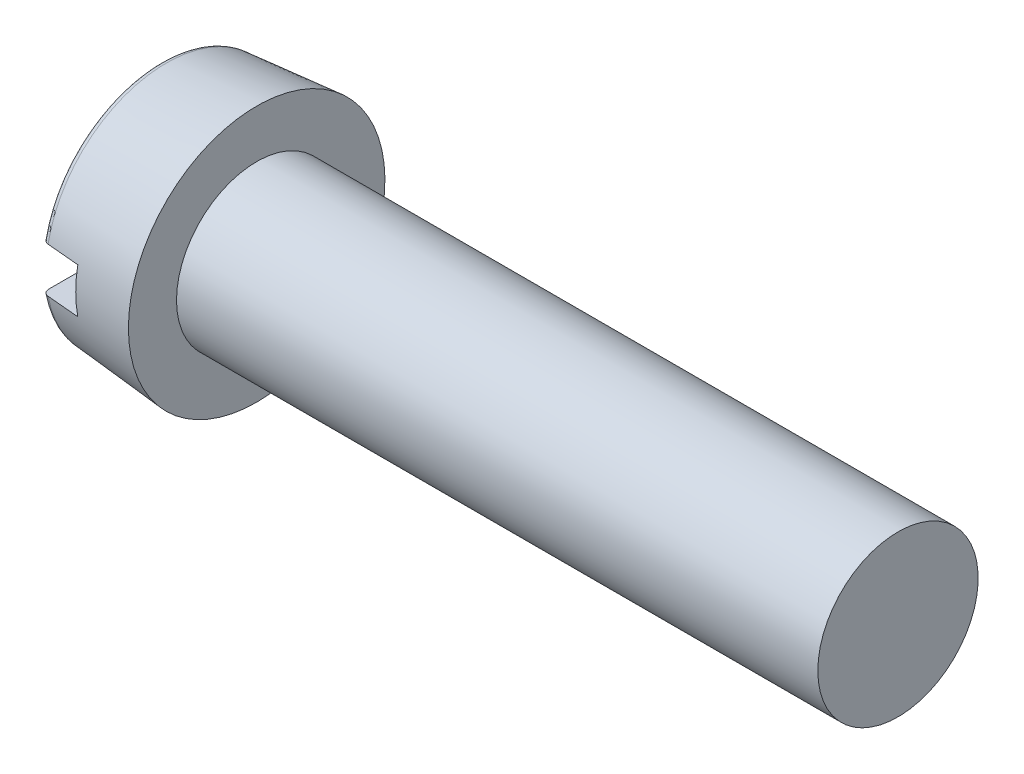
ISO-10303-21;
HEADER;
FILE_DESCRIPTION(('STEP AP214'),'2;1');
FILE_NAME('part.step','',(''),(''),'','','');
FILE_SCHEMA(('AUTOMOTIVE_DESIGN { 1 0 10303 214 1 1 1 1 }'));
ENDSEC;
DATA;
#1=APPLICATION_CONTEXT('core data for automotive mechanical design processes');
#2=APPLICATION_PROTOCOL_DEFINITION('international standard','automotive_design',2000,#1);
#3=PRODUCT_CONTEXT('',#1,'mechanical');
#4=PRODUCT('Part','Part','',(#3));
#5=PRODUCT_RELATED_PRODUCT_CATEGORY('part','',(#4));
#6=PRODUCT_DEFINITION_FORMATION('','',#4);
#7=PRODUCT_DEFINITION_CONTEXT('part definition',#1,'design');
#8=PRODUCT_DEFINITION('design','',#6,#7);
#9=PRODUCT_DEFINITION_SHAPE('','',#8);
#10=(LENGTH_UNIT() NAMED_UNIT(*) SI_UNIT(.MILLI.,.METRE.));
#11=(NAMED_UNIT(*) PLANE_ANGLE_UNIT() SI_UNIT($,.RADIAN.));
#12=(NAMED_UNIT(*) SI_UNIT($,.STERADIAN.) SOLID_ANGLE_UNIT());
#13=UNCERTAINTY_MEASURE_WITH_UNIT(LENGTH_MEASURE(1.E-05),#10,'distance_accuracy_value','');
#14=(GEOMETRIC_REPRESENTATION_CONTEXT(3) GLOBAL_UNCERTAINTY_ASSIGNED_CONTEXT((#13)) GLOBAL_UNIT_ASSIGNED_CONTEXT((#10,
#11,#12)) REPRESENTATION_CONTEXT('',''));
#15=CARTESIAN_POINT('',(0.,0.,0.));
#16=DIRECTION('',(0.,0.,1.));
#17=DIRECTION('',(1.,0.,0.));
#18=AXIS2_PLACEMENT_3D('',#15,#16,#17);
#19=CARTESIAN_POINT('',(0.,0.,0.));
#20=DIRECTION('',(1.,0.,0.));
#21=DIRECTION('',(0.,0.,-1.));
#22=AXIS2_PLACEMENT_3D('',#19,#20,#21);
#23=PLANE('',#22);
#24=CARTESIAN_POINT('',(0.,0.,0.));
#25=DIRECTION('',(1.,0.,0.));
#26=DIRECTION('',(0.,0.,-1.));
#27=AXIS2_PLACEMENT_3D('',#24,#25,#26);
#28=CIRCLE('',#27,7.10853554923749);
#29=CARTESIAN_POINT('',(0.,1.405,6.96830342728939));
#30=VERTEX_POINT('',#29);
#31=CARTESIAN_POINT('',(0.,1.405,-6.96830342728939));
#32=VERTEX_POINT('',#31);
#33=EDGE_CURVE('E102',#30,#32,#28,.F.);
#34=ORIENTED_EDGE('',*,*,#33,.T.);
#35=DIRECTION('',(0.,0.,-1.));
#36=VECTOR('',#35,1.);
#37=CARTESIAN_POINT('',(0.,1.405,-8.));
#38=LINE('',#37,#36);
#39=EDGE_CURVE('E99',#30,#32,#38,.T.);
#40=ORIENTED_EDGE('',*,*,#39,.F.);
#41=EDGE_LOOP('',(#34,#40));
#42=FACE_BOUND('',#41,.T.);
#43=ADVANCED_FACE('F32',(#42),#23,.F.);
#44=CARTESIAN_POINT('',(0.4,0.,0.));
#45=DIRECTION('',(1.,0.,0.));
#46=DIRECTION('',(0.,0.,-1.));
#47=AXIS2_PLACEMENT_3D('',#44,#45,#46);
#48=TOROIDAL_SURFACE('',#47,7.10853554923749,0.4);
#49=CARTESIAN_POINT('',(0.144237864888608,1.405,-7.28177651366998));
#50=CARTESIAN_POINT('',(0.161252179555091,1.405,-7.29618568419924));
#51=CARTESIAN_POINT('',(0.179480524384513,1.405,-7.30918376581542));
#52=CARTESIAN_POINT('',(0.217869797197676,1.405,-7.33195500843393));
#53=CARTESIAN_POINT('',(0.238032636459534,1.405,-7.34172493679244));
#54=CARTESIAN_POINT('',(0.279721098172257,1.405,-7.35772789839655));
#55=CARTESIAN_POINT('',(0.301246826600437,1.405,-7.36396065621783));
#56=CARTESIAN_POINT('',(0.345038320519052,1.405,-7.3726889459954));
#57=CARTESIAN_POINT('',(0.367303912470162,1.405,-7.37518534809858));
#58=CARTESIAN_POINT('',(0.411759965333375,1.405,-7.37636018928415));
#59=CARTESIAN_POINT('',(0.433949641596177,1.405,-7.37506847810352));
#60=CARTESIAN_POINT('',(0.477795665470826,1.405,-7.36877204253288));
#61=CARTESIAN_POINT('',(0.499452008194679,1.405,-7.36376728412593));
#62=CARTESIAN_POINT('',(0.541591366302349,1.405,-7.35020943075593));
#63=CARTESIAN_POINT('',(0.562075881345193,1.405,-7.34166099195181));
#64=CARTESIAN_POINT('',(0.601337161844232,1.405,-7.32127693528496));
#65=CARTESIAN_POINT('',(0.620113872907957,1.405,-7.30944121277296));
#66=CARTESIAN_POINT('',(0.655620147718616,1.405,-7.28271030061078));
#67=CARTESIAN_POINT('',(0.672329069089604,1.405,-7.26778770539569));
#68=CARTESIAN_POINT('',(0.703054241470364,1.405,-7.2353899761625));
#69=CARTESIAN_POINT('',(0.717070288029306,1.405,-7.21791464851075));
#70=CARTESIAN_POINT('',(0.742260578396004,1.405,-7.18060195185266));
#71=CARTESIAN_POINT('',(0.7533841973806,1.405,-7.16073041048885));
#72=CARTESIAN_POINT('',(0.772203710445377,1.405,-7.11942587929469));
#73=CARTESIAN_POINT('',(0.779899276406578,1.405,-7.09799274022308));
#74=CARTESIAN_POINT('',(0.791780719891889,1.405,-7.05377013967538));
#75=CARTESIAN_POINT('',(0.795902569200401,1.405,-7.03096346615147));
#76=CARTESIAN_POINT('',(0.800307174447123,1.405,-6.98498195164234));
#77=CARTESIAN_POINT('',(0.800589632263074,1.405,-6.96180708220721));
#78=CARTESIAN_POINT('',(0.797293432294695,1.405,-6.91546354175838));
#79=CARTESIAN_POINT('',(0.793670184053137,1.405,-6.89229802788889));
#80=CARTESIAN_POINT('',(0.782586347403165,1.405,-6.84690278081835));
#81=CARTESIAN_POINT('',(0.775125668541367,1.405,-6.82467306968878));
#82=CARTESIAN_POINT('',(0.756560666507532,1.405,-6.78179429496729));
#83=CARTESIAN_POINT('',(0.745457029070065,1.405,-6.7611449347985));
#84=CARTESIAN_POINT('',(0.719896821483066,1.405,-6.72203604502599));
#85=CARTESIAN_POINT('',(0.705440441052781,1.405,-6.70357639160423));
#86=CARTESIAN_POINT('',(0.673777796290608,1.405,-6.66964171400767));
#87=CARTESIAN_POINT('',(0.656610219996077,1.405,-6.65413061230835));
#88=CARTESIAN_POINT('',(0.619866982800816,1.405,-6.62628475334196));
#89=CARTESIAN_POINT('',(0.600291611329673,1.405,-6.61394961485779));
#90=CARTESIAN_POINT('',(0.559726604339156,1.405,-6.593080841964));
#91=CARTESIAN_POINT('',(0.538775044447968,1.405,-6.58447319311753));
#92=CARTESIAN_POINT('',(0.495707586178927,1.405,-6.57097278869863));
#93=CARTESIAN_POINT('',(0.473591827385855,1.405,-6.56607958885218));
#94=CARTESIAN_POINT('',(0.429262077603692,1.405,-6.56022606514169));
#95=CARTESIAN_POINT('',(0.40705742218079,1.405,-6.55919486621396));
#96=CARTESIAN_POINT('',(0.362794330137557,1.405,-6.56090217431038));
#97=CARTESIAN_POINT('',(0.340735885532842,1.405,-6.56364047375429));
#98=CARTESIAN_POINT('',(0.297539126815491,1.405,-6.57276690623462));
#99=CARTESIAN_POINT('',(0.276395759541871,1.405,-6.57913117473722));
#100=CARTESIAN_POINT('',(0.235464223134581,1.405,-6.59528964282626));
#101=CARTESIAN_POINT('',(0.215676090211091,1.405,-6.60508393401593));
#102=CARTESIAN_POINT('',(0.177826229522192,1.405,-6.6278994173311));
#103=CARTESIAN_POINT('',(0.159780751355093,1.405,-6.64094754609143));
#104=CARTESIAN_POINT('',(0.12608439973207,1.405,-6.66983570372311));
#105=CARTESIAN_POINT('',(0.110433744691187,1.405,-6.68567598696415));
#106=CARTESIAN_POINT('',(0.0816504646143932,1.405,-6.72001835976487));
#107=CARTESIAN_POINT('',(0.0685715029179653,1.405,-6.73856541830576));
#108=CARTESIAN_POINT('',(0.0456400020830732,1.405,-6.77755676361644));
#109=CARTESIAN_POINT('',(0.0357878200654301,1.405,-6.79800126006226));
#110=CARTESIAN_POINT('',(0.0193864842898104,1.405,-6.84065313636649));
#111=CARTESIAN_POINT('',(0.012908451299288,1.405,-6.8628878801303));
#112=CARTESIAN_POINT('',(0.00372599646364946,1.405,-6.90812297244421));
#113=CARTESIAN_POINT('',(0.0010217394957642,1.405,-6.93112335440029));
#114=CARTESIAN_POINT('',(-0.000552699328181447,1.405,-6.97753918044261));
#115=CARTESIAN_POINT('',(0.000624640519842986,1.405,-7.00095625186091));
#116=CARTESIAN_POINT('',(0.00689529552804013,1.405,-7.0472674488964));
#117=CARTESIAN_POINT('',(0.011989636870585,1.405,-7.0701614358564));
#118=CARTESIAN_POINT('',(0.0259690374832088,1.405,-7.11476232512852));
#119=CARTESIAN_POINT('',(0.0348543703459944,1.405,-7.13646914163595));
#120=CARTESIAN_POINT('',(0.0561821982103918,1.405,-7.17803716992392));
#121=CARTESIAN_POINT('',(0.0686202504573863,1.405,-7.19790064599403));
#122=CARTESIAN_POINT('',(0.0916734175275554,1.405,-7.22851144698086));
#123=CARTESIAN_POINT('',(0.101349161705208,1.405,-7.23997810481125));
#124=CARTESIAN_POINT('',(0.121913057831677,1.405,-7.26176785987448));
#125=CARTESIAN_POINT('',(0.132801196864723,1.405,-7.27209096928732));
#126=CARTESIAN_POINT('',(0.144237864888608,1.405,-7.28177651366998));
#127=B_SPLINE_CURVE_WITH_KNOTS('',3,(#49,#50,#51,#52,#53,#54,#55,#56,#57,#58,#59,#60,#61,#62,
#63,#64,#65,#66,#67,#68,#69,#70,#71,#72,#73,#74,#75,#76,#77,#78,#79,#80,#81,#82,#83,#84,#85,#86,
#87,#88,#89,#90,#91,#92,#93,#94,#95,#96,#97,#98,#99,#100,#101,#102,#103,#104,#105,#106,#107,
#108,#109,#110,#111,#112,#113,#114,#115,#116,#117,#118,#119,#120,#121,#122,#123,#124,#125,#126),
.UNSPECIFIED.,.T.,.F.,(4,2,2,2,2,2,2,2,2,2,2,2,2,2,2,2,2,2,2,2,2,2,2,2,2,2,2,2,2,2,2,2,2,2,2,2,
2,2,4),(0.,0.066834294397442,0.133735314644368,0.200641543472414,0.267532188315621,
0.333897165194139,0.400262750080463,0.466541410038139,0.532822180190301,0.599718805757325,
0.666620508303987,0.734624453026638,0.802634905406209,0.871840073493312,0.941050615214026,
1.0110597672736,1.08107056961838,1.15106820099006,1.22106187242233,1.29013451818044,
1.35919886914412,1.42682080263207,1.49443464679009,1.56080139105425,1.62716448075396,
1.69309576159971,1.75902880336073,1.82552692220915,1.892031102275,1.95980251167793,
2.0275814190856,2.09673640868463,2.1658944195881,2.23590224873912,2.30592842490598,
2.37595965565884,2.44590369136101,2.49082879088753,2.535753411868),.UNSPECIFIED.);
#128=CARTESIAN_POINT('',(0.365137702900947,1.405,-7.37436272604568));
#129=VERTEX_POINT('',#128);
#130=EDGE_CURVE('E56',#32,#129,#127,.T.);
#131=ORIENTED_EDGE('',*,*,#130,.F.);
#132=ORIENTED_EDGE('',*,*,#33,.F.);
#133=CARTESIAN_POINT('',(0.144881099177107,1.405,6.65373183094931));
#134=CARTESIAN_POINT('',(0.161881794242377,1.405,6.63934448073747));
#135=CARTESIAN_POINT('',(0.180090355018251,1.405,6.62636253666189));
#136=CARTESIAN_POINT('',(0.21843547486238,1.405,6.6036162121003));
#137=CARTESIAN_POINT('',(0.23857385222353,1.405,6.59385490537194));
#138=CARTESIAN_POINT('',(0.280217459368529,1.405,6.57786728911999));
#139=CARTESIAN_POINT('',(0.301723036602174,1.405,6.57164188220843));
#140=CARTESIAN_POINT('',(0.345474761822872,1.405,6.56293606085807));
#141=CARTESIAN_POINT('',(0.367720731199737,1.405,6.56045474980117));
#142=CARTESIAN_POINT('',(0.412075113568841,1.405,6.55932205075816));
#143=CARTESIAN_POINT('',(0.434182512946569,1.405,6.56063066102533));
#144=CARTESIAN_POINT('',(0.477861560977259,1.405,6.56694897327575));
#145=CARTESIAN_POINT('',(0.499433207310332,1.405,6.57195869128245));
#146=CARTESIAN_POINT('',(0.541394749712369,1.405,6.58550595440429));
#147=CARTESIAN_POINT('',(0.561786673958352,1.405,6.59403722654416));
#148=CARTESIAN_POINT('',(0.600873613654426,1.405,6.6143609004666));
#149=CARTESIAN_POINT('',(0.619568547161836,1.405,6.62615345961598));
#150=CARTESIAN_POINT('',(0.65499110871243,1.405,6.65281311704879));
#151=CARTESIAN_POINT('',(0.671690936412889,1.405,6.6677171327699));
#152=CARTESIAN_POINT('',(0.702413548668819,1.405,6.70006655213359));
#153=CARTESIAN_POINT('',(0.716436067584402,1.405,6.71751220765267));
#154=CARTESIAN_POINT('',(0.741711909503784,1.405,6.75483184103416));
#155=CARTESIAN_POINT('',(0.752902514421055,1.405,6.77474829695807));
#156=CARTESIAN_POINT('',(0.771852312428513,1.405,6.81615166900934));
#157=CARTESIAN_POINT('',(0.779611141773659,1.405,6.83763875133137));
#158=CARTESIAN_POINT('',(0.791617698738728,1.405,6.88200474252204));
#159=CARTESIAN_POINT('',(0.795797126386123,1.405,6.90490215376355));
#160=CARTESIAN_POINT('',(0.800289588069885,1.405,6.95107381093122));
#161=CARTESIAN_POINT('',(0.800602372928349,1.405,6.97434808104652));
#162=CARTESIAN_POINT('',(0.797334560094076,1.405,7.02082625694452));
#163=CARTESIAN_POINT('',(0.793720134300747,1.405,7.04402779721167));
#164=CARTESIAN_POINT('',(0.782630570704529,1.405,7.08949023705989));
#165=CARTESIAN_POINT('',(0.775155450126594,1.405,7.11175114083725));
#166=CARTESIAN_POINT('',(0.756575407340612,1.405,7.15458716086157));
#167=CARTESIAN_POINT('',(0.74548668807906,1.405,7.17516929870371));
#168=CARTESIAN_POINT('',(0.719961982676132,1.405,7.21414252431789));
#169=CARTESIAN_POINT('',(0.705526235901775,1.405,7.23253376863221));
#170=CARTESIAN_POINT('',(0.673939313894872,1.405,7.26630759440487));
#171=CARTESIAN_POINT('',(0.656831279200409,1.405,7.28173051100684));
#172=CARTESIAN_POINT('',(0.620227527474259,1.405,7.30942091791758));
#173=CARTESIAN_POINT('',(0.600732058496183,1.405,7.32168873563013));
#174=CARTESIAN_POINT('',(0.560289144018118,1.405,7.34248600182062));
#175=CARTESIAN_POINT('',(0.539374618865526,1.405,7.3510794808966));
#176=CARTESIAN_POINT('',(0.496387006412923,1.405,7.36457593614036));
#177=CARTESIAN_POINT('',(0.474314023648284,1.405,7.36947924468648));
#178=CARTESIAN_POINT('',(0.429971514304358,1.405,7.37539616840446));
#179=CARTESIAN_POINT('',(0.407709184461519,1.405,7.37646382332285));
#180=CARTESIAN_POINT('',(0.363324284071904,1.405,7.37482660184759));
#181=CARTESIAN_POINT('',(0.341201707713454,1.405,7.37212188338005));
#182=CARTESIAN_POINT('',(0.297832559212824,1.405,7.36304702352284));
#183=CARTESIAN_POINT('',(0.276582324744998,1.405,7.3566943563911));
#184=CARTESIAN_POINT('',(0.235440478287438,1.405,7.34053288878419));
#185=CARTESIAN_POINT('',(0.215548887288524,1.405,7.33072403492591));
#186=CARTESIAN_POINT('',(0.177550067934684,1.405,7.30787537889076));
#187=CARTESIAN_POINT('',(0.15945464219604,1.405,7.294815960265));
#188=CARTESIAN_POINT('',(0.1256727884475,1.405,7.26588542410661));
#189=CARTESIAN_POINT('',(0.109986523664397,1.405,7.25001411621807));
#190=CARTESIAN_POINT('',(0.0812162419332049,1.405,7.21566368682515));
#191=CARTESIAN_POINT('',(0.0681741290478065,1.405,7.19714947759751));
#192=CARTESIAN_POINT('',(0.0453189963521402,1.405,7.15822553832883));
#193=CARTESIAN_POINT('',(0.0355062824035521,1.405,7.1378156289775));
#194=CARTESIAN_POINT('',(0.0192044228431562,1.405,7.09528646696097));
#195=CARTESIAN_POINT('',(0.0127782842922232,1.405,7.07314305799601));
#196=CARTESIAN_POINT('',(0.00367706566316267,1.405,7.028099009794));
#197=CARTESIAN_POINT('',(0.00100217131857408,1.405,7.00519833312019));
#198=CARTESIAN_POINT('',(-0.000546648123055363,1.405,6.95894569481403));
#199=CARTESIAN_POINT('',(0.000633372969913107,1.405,6.93559191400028));
#200=CARTESIAN_POINT('',(0.00688116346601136,1.405,6.88940306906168));
#201=CARTESIAN_POINT('',(0.011950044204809,1.405,6.86656815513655));
#202=CARTESIAN_POINT('',(0.0258751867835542,1.405,6.82197547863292));
#203=CARTESIAN_POINT('',(0.0347478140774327,1.405,6.80022282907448));
#204=CARTESIAN_POINT('',(0.0560477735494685,1.405,6.75855467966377));
#205=CARTESIAN_POINT('',(0.0684707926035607,1.405,6.73863698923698));
#206=CARTESIAN_POINT('',(0.0916123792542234,1.405,6.70778013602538));
#207=CARTESIAN_POINT('',(0.101407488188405,1.405,6.6961371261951));
#208=CARTESIAN_POINT('',(0.122241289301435,1.405,6.67402188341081));
#209=CARTESIAN_POINT('',(0.133279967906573,1.405,6.66354963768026));
#210=CARTESIAN_POINT('',(0.144881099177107,1.405,6.65373183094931));
#211=B_SPLINE_CURVE_WITH_KNOTS('',3,(#133,#134,#135,#136,#137,#138,#139,#140,#141,#142,#143,
#144,#145,#146,#147,#148,#149,#150,#151,#152,#153,#154,#155,#156,#157,#158,#159,#160,#161,#162,
#163,#164,#165,#166,#167,#168,#169,#170,#171,#172,#173,#174,#175,#176,#177,#178,#179,#180,#181,
#182,#183,#184,#185,#186,#187,#188,#189,#190,#191,#192,#193,#194,#195,#196,#197,#198,#199,#200,
#201,#202,#203,#204,#205,#206,#207,#208,#209,#210),.UNSPECIFIED.,.T.,.F.,(4,2,2,2,2,2,2,2,2,2,2,
2,2,2,2,2,2,2,2,2,2,2,2,2,2,2,2,2,2,2,2,2,2,2,2,2,2,2,4),(0.,0.066760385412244,0.13358430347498,
0.200425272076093,0.267250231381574,0.333372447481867,0.39949494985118,0.465500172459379,
0.531508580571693,0.598349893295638,0.665197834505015,0.733417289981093,0.801643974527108,
0.871145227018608,0.940650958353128,1.01076017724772,1.08086908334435,1.15066785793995,
1.22046164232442,1.28922713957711,1.35798549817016,1.42549128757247,1.49299099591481,
1.55953590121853,1.62607802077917,1.69230402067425,1.75853104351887,1.82516785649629,
1.89180918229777,1.95943581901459,2.02706885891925,2.09591935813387,2.1647732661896,
2.23459482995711,2.30443635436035,2.37458143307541,2.44464165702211,2.49019887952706,
2.53575560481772),.UNSPECIFIED.);
#212=CARTESIAN_POINT('',(0.365137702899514,1.405,7.37436272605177));
#213=VERTEX_POINT('',#212);
#214=EDGE_CURVE('E92',#213,#30,#211,.T.);
#215=ORIENTED_EDGE('',*,*,#214,.F.);
#216=CARTESIAN_POINT('',(0.365137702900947,0.,0.));
#217=DIRECTION('',(-1.,0.,0.));
#218=DIRECTION('',(0.,0.,1.));
#219=AXIS2_PLACEMENT_3D('',#216,#217,#218);
#220=CIRCLE('',#219,7.50701342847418);
#221=EDGE_CURVE('E101',#129,#213,#220,.F.);
#222=ORIENTED_EDGE('',*,*,#221,.F.);
#223=EDGE_LOOP('',(#131,#132,#215,#222));
#224=FACE_BOUND('',#223,.T.);
#225=ADVANCED_FACE('F181',(#224),#48,.T.);
#226=CARTESIAN_POINT('',(0.,-1.405,-6.96830342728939));
#227=VERTEX_POINT('',#226);
#228=CARTESIAN_POINT('',(0.,-1.405,6.96830342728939));
#229=VERTEX_POINT('',#228);
#230=EDGE_CURVE('E98',#227,#229,#28,.F.);
#231=ORIENTED_EDGE('',*,*,#230,.T.);
#232=DIRECTION('',(0.,0.,1.));
#233=VECTOR('',#232,1.);
#234=CARTESIAN_POINT('',(0.,-1.405,-8.));
#235=LINE('',#234,#233);
#236=EDGE_CURVE('E48',#227,#229,#235,.T.);
#237=ORIENTED_EDGE('',*,*,#236,.F.);
#238=EDGE_LOOP('',(#231,#237));
#239=FACE_BOUND('',#238,.T.);
#240=ADVANCED_FACE('F97',(#239),#23,.F.);
#241=CARTESIAN_POINT('',(6.,0.,0.));
#242=DIRECTION('',(1.,0.,0.));
#243=DIRECTION('',(0.,0.,-1.));
#244=AXIS2_PLACEMENT_3D('',#241,#242,#243);
#245=CONICAL_SURFACE('',#244,8.,0.0872664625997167);
#246=CARTESIAN_POINT('',(2.4,0.,0.));
#247=DIRECTION('',(-1.,0.,0.));
#248=DIRECTION('',(0.,0.,1.));
#249=AXIS2_PLACEMENT_3D('',#246,#247,#248);
#250=CIRCLE('',#249,7.68504081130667);
#251=CARTESIAN_POINT('',(2.4,1.405,-7.55551634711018));
#252=VERTEX_POINT('',#251);
#253=CARTESIAN_POINT('',(2.4,-1.405,-7.55551634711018));
#254=VERTEX_POINT('',#253);
#255=EDGE_CURVE('E11',#252,#254,#250,.T.);
#256=ORIENTED_EDGE('',*,*,#255,.F.);
#257=CARTESIAN_POINT('',(15.1504351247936,1.405,-8.68768206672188));
#258=CARTESIAN_POINT('',(12.833995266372,1.405,-8.48238189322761));
#259=CARTESIAN_POINT('',(10.5175708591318,1.405,-8.27690717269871));
#260=CARTESIAN_POINT('',(5.88476320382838,1.405,-7.86549606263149));
#261=CARTESIAN_POINT('',(3.5683799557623,1.405,-7.65955967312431));
#262=CARTESIAN_POINT('',(-1.06433550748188,1.405,-7.24711261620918));
#263=CARTESIAN_POINT('',(-3.38066772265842,1.405,-7.0406019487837));
#264=CARTESIAN_POINT('',(-8.01326420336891,1.405,-6.62681820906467));
#265=CARTESIAN_POINT('',(-10.3295284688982,1.405,-6.41954513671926));
#266=CARTESIAN_POINT('',(-12.6457501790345,1.405,-6.2117968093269));
#267=B_SPLINE_CURVE_WITH_KNOTS('',3,(#257,#258,#259,#260,#261,#262,#263,#264,#265,#266),
.UNSPECIFIED.,.F.,.F.,(4,2,2,2,4),(0.,6.97655905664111,13.9531176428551,20.9296764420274,
27.9062357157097),.UNSPECIFIED.);
#268=EDGE_CURVE('E159',#252,#129,#267,.T.);
#269=ORIENTED_EDGE('',*,*,#268,.T.);
#270=ORIENTED_EDGE('',*,*,#221,.T.);
#271=CARTESIAN_POINT('',(-12.6457501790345,1.405,6.2117968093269));
#272=CARTESIAN_POINT('',(-8.75593875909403,1.405,6.56067612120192));
#273=CARTESIAN_POINT('',(-4.86600863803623,1.405,6.90822798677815));
#274=CARTESIAN_POINT('',(-0.233327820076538,1.405,7.32106601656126));
#275=CARTESIAN_POINT('',(0.5093458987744,1.405,7.3872159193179));
#276=CARTESIAN_POINT('',(3.56837994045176,1.405,7.65956069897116));
#277=CARTESIAN_POINT('',(5.88476332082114,1.405,7.86549658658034));
#278=CARTESIAN_POINT('',(10.517571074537,1.405,8.27690667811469));
#279=CARTESIAN_POINT('',(12.8339954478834,1.405,8.48238088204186));
#280=CARTESIAN_POINT('',(15.1504351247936,1.405,8.68768206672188));
#281=B_SPLINE_CURVE_WITH_KNOTS('',3,(#271,#272,#273,#274,#275,#276,#277,#278,#279,#280),
.UNSPECIFIED.,.F.,.F.,(4,2,2,2,4),(0.,11.7162763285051,13.9531179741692,20.9296768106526,
27.9062356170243),.UNSPECIFIED.);
#282=CARTESIAN_POINT('',(2.4,1.405,7.55551634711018));
#283=VERTEX_POINT('',#282);
#284=EDGE_CURVE('E154',#213,#283,#281,.T.);
#285=ORIENTED_EDGE('',*,*,#284,.T.);
#286=CARTESIAN_POINT('',(2.4,-1.405,7.55551634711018));
#287=VERTEX_POINT('',#286);
#288=EDGE_CURVE('E37',#287,#283,#250,.T.);
#289=ORIENTED_EDGE('',*,*,#288,.F.);
#290=CARTESIAN_POINT('',(15.1504351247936,-1.405,8.68768206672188));
#291=CARTESIAN_POINT('',(12.833995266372,-1.405,8.48238189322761));
#292=CARTESIAN_POINT('',(10.5175708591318,-1.405,8.27690717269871));
#293=CARTESIAN_POINT('',(5.88476320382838,-1.405,7.86549606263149));
#294=CARTESIAN_POINT('',(3.5683799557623,-1.405,7.65955967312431));
#295=CARTESIAN_POINT('',(-1.06433550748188,-1.405,7.24711261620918));
#296=CARTESIAN_POINT('',(-3.38066772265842,-1.405,7.0406019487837));
#297=CARTESIAN_POINT('',(-8.01326420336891,-1.405,6.62681820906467));
#298=CARTESIAN_POINT('',(-10.3295284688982,-1.405,6.41954513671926));
#299=CARTESIAN_POINT('',(-12.6457501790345,-1.405,6.2117968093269));
#300=B_SPLINE_CURVE_WITH_KNOTS('',3,(#290,#291,#292,#293,#294,#295,#296,#297,#298,#299),
.UNSPECIFIED.,.F.,.F.,(4,2,2,2,4),(0.,6.97655905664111,13.9531176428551,20.9296764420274,
27.9062357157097),.UNSPECIFIED.);
#301=CARTESIAN_POINT('',(0.365137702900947,-1.405,7.37436272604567));
#302=VERTEX_POINT('',#301);
#303=EDGE_CURVE('E132',#287,#302,#300,.T.);
#304=ORIENTED_EDGE('',*,*,#303,.T.);
#305=CARTESIAN_POINT('',(0.365137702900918,-1.405,-7.37436272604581));
#306=VERTEX_POINT('',#305);
#307=EDGE_CURVE('E105',#302,#306,#220,.F.);
#308=ORIENTED_EDGE('',*,*,#307,.T.);
#309=CARTESIAN_POINT('',(-12.6457501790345,-1.405,-6.2117968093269));
#310=CARTESIAN_POINT('',(-8.75593875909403,-1.405,-6.56067612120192));
#311=CARTESIAN_POINT('',(-4.86600863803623,-1.405,-6.90822798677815));
#312=CARTESIAN_POINT('',(-0.233327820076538,-1.405,-7.32106601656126));
#313=CARTESIAN_POINT('',(0.5093458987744,-1.405,-7.3872159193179));
#314=CARTESIAN_POINT('',(3.56837994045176,-1.405,-7.65956069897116));
#315=CARTESIAN_POINT('',(5.88476332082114,-1.405,-7.86549658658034));
#316=CARTESIAN_POINT('',(10.517571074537,-1.405,-8.27690667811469));
#317=CARTESIAN_POINT('',(12.8339954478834,-1.405,-8.48238088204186));
#318=CARTESIAN_POINT('',(15.1504351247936,-1.405,-8.68768206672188));
#319=B_SPLINE_CURVE_WITH_KNOTS('',3,(#309,#310,#311,#312,#313,#314,#315,#316,#317,#318),
.UNSPECIFIED.,.F.,.F.,(4,2,2,2,4),(0.,11.7162763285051,13.9531179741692,20.9296768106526,
27.9062356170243),.UNSPECIFIED.);
#320=EDGE_CURVE('E87',#306,#254,#319,.T.);
#321=ORIENTED_EDGE('',*,*,#320,.T.);
#322=EDGE_LOOP('',(#256,#269,#270,#285,#289,#304,#308,#321));
#323=FACE_BOUND('',#322,.T.);
#324=CARTESIAN_POINT('',(6.,0.,0.));
#325=DIRECTION('',(-1.,0.,0.));
#326=DIRECTION('',(0.,0.,1.));
#327=AXIS2_PLACEMENT_3D('',#324,#325,#326);
#328=CIRCLE('',#327,8.);
#329=CARTESIAN_POINT('',(6.,0.,8.));
#330=VERTEX_POINT('',#329);
#331=EDGE_CURVE('E108',#330,#330,#328,.T.);
#332=ORIENTED_EDGE('',*,*,#331,.T.);
#333=EDGE_LOOP('',(#332));
#334=FACE_BOUND('',#333,.T.);
#335=ADVANCED_FACE('F144',(#323,#334),#245,.T.);
#336=CARTESIAN_POINT('',(6.,8.,0.));
#337=DIRECTION('',(-1.,0.,0.));
#338=DIRECTION('',(0.,0.,1.));
#339=AXIS2_PLACEMENT_3D('',#336,#337,#338);
#340=PLANE('',#339);
#341=ORIENTED_EDGE('',*,*,#331,.F.);
#342=EDGE_LOOP('',(#341));
#343=FACE_BOUND('',#342,.T.);
#344=CARTESIAN_POINT('',(6.,0.,0.));
#345=DIRECTION('',(-1.,0.,0.));
#346=DIRECTION('',(0.,0.,1.));
#347=AXIS2_PLACEMENT_3D('',#344,#345,#346);
#348=CIRCLE('',#347,5.);
#349=CARTESIAN_POINT('',(6.,0.,5.));
#350=VERTEX_POINT('',#349);
#351=EDGE_CURVE('E166',#350,#350,#348,.T.);
#352=ORIENTED_EDGE('',*,*,#351,.T.);
#353=EDGE_LOOP('',(#352));
#354=FACE_BOUND('',#353,.T.);
#355=ADVANCED_FACE('F148',(#343,#354),#340,.F.);
#356=CARTESIAN_POINT('',(0.,0.,0.));
#357=DIRECTION('',(-1.,0.,0.));
#358=DIRECTION('',(0.,0.,1.));
#359=AXIS2_PLACEMENT_3D('',#356,#357,#358);
#360=CYLINDRICAL_SURFACE('',#359,5.);
#361=ORIENTED_EDGE('',*,*,#351,.F.);
#362=EDGE_LOOP('',(#361));
#363=FACE_BOUND('',#362,.T.);
#364=CARTESIAN_POINT('',(46.,0.,0.));
#365=DIRECTION('',(-1.,0.,0.));
#366=DIRECTION('',(0.,0.,1.));
#367=AXIS2_PLACEMENT_3D('',#364,#365,#366);
#368=CIRCLE('',#367,5.);
#369=CARTESIAN_POINT('',(46.,0.,5.));
#370=VERTEX_POINT('',#369);
#371=EDGE_CURVE('E164',#370,#370,#368,.T.);
#372=ORIENTED_EDGE('',*,*,#371,.T.);
#373=EDGE_LOOP('',(#372));
#374=FACE_BOUND('',#373,.T.);
#375=ADVANCED_FACE('F175',(#363,#374),#360,.T.);
#376=CARTESIAN_POINT('',(46.,5.,0.));
#377=DIRECTION('',(-1.,0.,0.));
#378=DIRECTION('',(0.,0.,1.));
#379=AXIS2_PLACEMENT_3D('',#376,#377,#378);
#380=PLANE('',#379);
#381=ORIENTED_EDGE('',*,*,#371,.F.);
#382=EDGE_LOOP('',(#381));
#383=FACE_BOUND('',#382,.T.);
#384=ADVANCED_FACE('F125',(#383),#380,.F.);
#385=CARTESIAN_POINT('',(0.144237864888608,-1.405,-7.28177651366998));
#386=CARTESIAN_POINT('',(0.126791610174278,-1.405,-7.26699886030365));
#387=CARTESIAN_POINT('',(0.110596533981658,-1.405,-7.25071528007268));
#388=CARTESIAN_POINT('',(0.0811700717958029,-1.405,-7.2156354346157));
#389=CARTESIAN_POINT('',(0.0679429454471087,-1.405,-7.19683561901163));
#390=CARTESIAN_POINT('',(0.0448316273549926,-1.405,-7.15731318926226));
#391=CARTESIAN_POINT('',(0.0349433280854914,-1.405,-7.13659297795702));
#392=CARTESIAN_POINT('',(0.0187391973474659,-1.405,-7.09380836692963));
#393=CARTESIAN_POINT('',(0.0124224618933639,-1.405,-7.07174430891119));
#394=CARTESIAN_POINT('',(0.00345107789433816,-1.405,-7.02659167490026));
#395=CARTESIAN_POINT('',(0.000844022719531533,-1.405,-7.00349363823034));
#396=CARTESIAN_POINT('',(-0.000495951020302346,-1.405,-6.95718374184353));
#397=CARTESIAN_POINT('',(0.000771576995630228,-1.405,-6.93397186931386));
#398=CARTESIAN_POINT('',(0.00717690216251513,-1.405,-6.8878606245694));
#399=CARTESIAN_POINT('',(0.0123516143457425,-1.405,-6.86496636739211));
#400=CARTESIAN_POINT('',(0.0264813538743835,-1.405,-6.82037448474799));
#401=CARTESIAN_POINT('',(0.035436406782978,-1.405,-6.79867686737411));
#402=CARTESIAN_POINT('',(0.0568637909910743,-1.405,-6.75717121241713));
#403=CARTESIAN_POINT('',(0.069325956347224,-1.405,-6.73735793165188));
#404=CARTESIAN_POINT('',(0.0974481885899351,-1.405,-6.70014670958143));
#405=CARTESIAN_POINT('',(0.11310801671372,-1.405,-6.68274858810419));
#406=CARTESIAN_POINT('',(0.146932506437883,-1.405,-6.65115654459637));
#407=CARTESIAN_POINT('',(0.165055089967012,-1.405,-6.63691759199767));
#408=CARTESIAN_POINT('',(0.203476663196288,-1.405,-6.61176291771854));
#409=CARTESIAN_POINT('',(0.223775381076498,-1.405,-6.6008467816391));
#410=CARTESIAN_POINT('',(0.265508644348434,-1.405,-6.58289212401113));
#411=CARTESIAN_POINT('',(0.28690981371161,-1.405,-6.57577600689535));
#412=CARTESIAN_POINT('',(0.330613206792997,-1.405,-6.56530652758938));
#413=CARTESIAN_POINT('',(0.352915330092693,-1.405,-6.5619527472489));
#414=CARTESIAN_POINT('',(0.397388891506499,-1.405,-6.55914311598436));
#415=CARTESIAN_POINT('',(0.419556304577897,-1.405,-6.55962318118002));
#416=CARTESIAN_POINT('',(0.463492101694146,-1.405,-6.56431302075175));
#417=CARTESIAN_POINT('',(0.485260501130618,-1.405,-6.56852265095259));
#418=CARTESIAN_POINT('',(0.527706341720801,-1.405,-6.58051413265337));
#419=CARTESIAN_POINT('',(0.54838732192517,-1.405,-6.58828347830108));
#420=CARTESIAN_POINT('',(0.588171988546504,-1.405,-6.60714642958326));
#421=CARTESIAN_POINT('',(0.607275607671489,-1.405,-6.61824017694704));
#422=CARTESIAN_POINT('',(0.643601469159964,-1.405,-6.64355808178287));
#423=CARTESIAN_POINT('',(0.660800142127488,-1.405,-6.65781603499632));
#424=CARTESIAN_POINT('',(0.692618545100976,-1.405,-6.68896518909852));
#425=CARTESIAN_POINT('',(0.707238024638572,-1.405,-6.70585664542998));
#426=CARTESIAN_POINT('',(0.733796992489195,-1.405,-6.74215506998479));
#427=CARTESIAN_POINT('',(0.745676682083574,-1.405,-6.76160578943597));
#428=CARTESIAN_POINT('',(0.766074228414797,-1.405,-6.80219644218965));
#429=CARTESIAN_POINT('',(0.77459172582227,-1.405,-6.82333655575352));
#430=CARTESIAN_POINT('',(0.788186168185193,-1.405,-6.86714554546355));
#431=CARTESIAN_POINT('',(0.793193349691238,-1.405,-6.88983608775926));
#432=CARTESIAN_POINT('',(0.799369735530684,-1.405,-6.93573422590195));
#433=CARTESIAN_POINT('',(0.800538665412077,-1.405,-6.95894185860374));
#434=CARTESIAN_POINT('',(0.798997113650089,-1.405,-7.00546279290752));
#435=CARTESIAN_POINT('',(0.796247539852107,-1.405,-7.02877481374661));
#436=CARTESIAN_POINT('',(0.786862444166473,-1.405,-7.07460410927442));
#437=CARTESIAN_POINT('',(0.780226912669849,-1.405,-7.09712138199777));
#438=CARTESIAN_POINT('',(0.763262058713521,-1.405,-7.14064175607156));
#439=CARTESIAN_POINT('',(0.752943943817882,-1.405,-7.16164922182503));
#440=CARTESIAN_POINT('',(0.728879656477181,-1.405,-7.20160053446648));
#441=CARTESIAN_POINT('',(0.715133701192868,-1.405,-7.22054451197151));
#442=CARTESIAN_POINT('',(0.684801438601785,-1.405,-7.25554321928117));
#443=CARTESIAN_POINT('',(0.668257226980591,-1.405,-7.27163441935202));
#444=CARTESIAN_POINT('',(0.632658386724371,-1.405,-7.30074817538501));
#445=CARTESIAN_POINT('',(0.613604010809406,-1.405,-7.3137710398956));
#446=CARTESIAN_POINT('',(0.573898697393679,-1.405,-7.33612790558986));
#447=CARTESIAN_POINT('',(0.553283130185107,-1.405,-7.34552473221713));
#448=CARTESIAN_POINT('',(0.510752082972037,-1.405,-7.36066363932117));
#449=CARTESIAN_POINT('',(0.488836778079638,-1.405,-7.36640621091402));
#450=CARTESIAN_POINT('',(0.444681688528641,-1.405,-7.3739957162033));
#451=CARTESIAN_POINT('',(0.422451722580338,-1.405,-7.37589987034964));
#452=CARTESIAN_POINT('',(0.377983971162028,-1.405,-7.37592445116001));
#453=CARTESIAN_POINT('',(0.355746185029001,-1.405,-7.3740440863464));
#454=CARTESIAN_POINT('',(0.312029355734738,-1.405,-7.36657964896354));
#455=CARTESIAN_POINT('',(0.290546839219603,-1.405,-7.36101580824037));
#456=CARTESIAN_POINT('',(0.248833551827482,-1.405,-7.3463795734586));
#457=CARTESIAN_POINT('',(0.22860127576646,-1.405,-7.33731149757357));
#458=CARTESIAN_POINT('',(0.197725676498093,-1.405,-7.32025988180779));
#459=CARTESIAN_POINT('',(0.186499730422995,-1.405,-7.31330813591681));
#460=CARTESIAN_POINT('',(0.164789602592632,-1.405,-7.29833024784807));
#461=CARTESIAN_POINT('',(0.154305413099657,-1.405,-7.2903041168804));
#462=CARTESIAN_POINT('',(0.144237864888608,-1.405,-7.28177651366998));
#463=B_SPLINE_CURVE_WITH_KNOTS('',3,(#385,#386,#387,#388,#389,#390,#391,#392,#393,#394,#395,
#396,#397,#398,#399,#400,#401,#402,#403,#404,#405,#406,#407,#408,#409,#410,#411,#412,#413,#414,
#415,#416,#417,#418,#419,#420,#421,#422,#423,#424,#425,#426,#427,#428,#429,#430,#431,#432,#433,
#434,#435,#436,#437,#438,#439,#440,#441,#442,#443,#444,#445,#446,#447,#448,#449,#450,#451,#452,
#453,#454,#455,#456,#457,#458,#459,#460,#461,#462),.UNSPECIFIED.,.T.,.F.,(4,2,2,2,2,2,2,2,2,2,2,
2,2,2,2,2,2,2,2,2,2,2,2,2,2,2,2,2,2,2,2,2,2,2,2,2,2,2,4),(0.,0.0685420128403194,
0.137181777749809,0.20573678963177,0.274274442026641,0.343683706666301,0.413100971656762,
0.483182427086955,0.553264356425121,0.623145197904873,0.69302082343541,0.761825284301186,
0.83062116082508,0.897952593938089,0.965276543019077,1.03147753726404,1.09767597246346,
1.16364360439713,1.22961404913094,1.29632626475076,1.36304495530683,1.43110519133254,
1.49917269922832,1.56855730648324,1.63794687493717,1.70803355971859,1.77812041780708,
1.8479957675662,1.91786669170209,1.98676730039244,2.05566097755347,2.12330075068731,
2.19093143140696,2.25754623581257,2.32417497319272,2.39044074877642,2.45662512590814,
2.49617844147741,2.53573134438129),.UNSPECIFIED.);
#464=EDGE_CURVE('E83',#306,#227,#463,.T.);
#465=ORIENTED_EDGE('',*,*,#464,.F.);
#466=ORIENTED_EDGE('',*,*,#307,.F.);
#467=CARTESIAN_POINT('',(0.144881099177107,-1.405,6.65373183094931));
#468=CARTESIAN_POINT('',(0.127361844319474,-1.405,6.66856066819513));
#469=CARTESIAN_POINT('',(0.11109994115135,-1.405,6.68490434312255));
#470=CARTESIAN_POINT('',(0.0815501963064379,-1.405,6.72011497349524));
#471=CARTESIAN_POINT('',(0.0682667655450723,-1.405,6.73898560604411));
#472=CARTESIAN_POINT('',(0.0450534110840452,-1.405,6.77865589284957));
#473=CARTESIAN_POINT('',(0.0351192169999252,-1.405,6.79945304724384));
#474=CARTESIAN_POINT('',(0.0188356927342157,-1.405,6.84239769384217));
#475=CARTESIAN_POINT('',(0.0124854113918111,-1.405,6.86454482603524));
#476=CARTESIAN_POINT('',(0.00346464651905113,-1.405,6.9098738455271));
#477=CARTESIAN_POINT('',(0.000842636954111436,-1.405,6.93306538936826));
#478=CARTESIAN_POINT('',(-0.000497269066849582,-1.405,6.97956297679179));
#479=CARTESIAN_POINT('',(0.000785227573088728,-1.405,7.002869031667));
#480=CARTESIAN_POINT('',(0.00724774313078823,-1.405,7.04908019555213));
#481=CARTESIAN_POINT('',(0.012451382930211,-1.405,7.07198201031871));
#482=CARTESIAN_POINT('',(0.0266560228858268,-1.405,7.11657717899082));
#483=CARTESIAN_POINT('',(0.0356569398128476,-1.405,7.13827055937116));
#484=CARTESIAN_POINT('',(0.0571485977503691,-1.405,7.17966422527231));
#485=CARTESIAN_POINT('',(0.069614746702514,-1.405,7.19937726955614));
#486=CARTESIAN_POINT('',(0.0977303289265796,-1.405,7.23638609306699));
#487=CARTESIAN_POINT('',(0.113379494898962,-1.405,7.2536820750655));
#488=CARTESIAN_POINT('',(0.147151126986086,-1.405,7.285064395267));
#489=CARTESIAN_POINT('',(0.165229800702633,-1.405,7.29919785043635));
#490=CARTESIAN_POINT('',(0.20353930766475,-1.405,7.32416297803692));
#491=CARTESIAN_POINT('',(0.223769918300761,-1.405,7.33499499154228));
#492=CARTESIAN_POINT('',(0.265417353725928,-1.405,7.35284828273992));
#493=CARTESIAN_POINT('',(0.286806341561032,-1.405,7.35993451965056));
#494=CARTESIAN_POINT('',(0.330477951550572,-1.405,7.37036408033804));
#495=CARTESIAN_POINT('',(0.352760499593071,-1.405,7.3737077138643));
#496=CARTESIAN_POINT('',(0.397287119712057,-1.405,7.37652765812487));
#497=CARTESIAN_POINT('',(0.41952816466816,-1.405,7.37605198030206));
#498=CARTESIAN_POINT('',(0.463611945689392,-1.405,7.37136264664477));
#499=CARTESIAN_POINT('',(0.485454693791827,-1.405,7.36714910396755));
#500=CARTESIAN_POINT('',(0.528068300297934,-1.405,7.35513103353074));
#501=CARTESIAN_POINT('',(0.548841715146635,-1.405,7.34733555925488));
#502=CARTESIAN_POINT('',(0.588799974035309,-1.405,7.3283953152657));
#503=CARTESIAN_POINT('',(0.607984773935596,-1.405,7.31725045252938));
#504=CARTESIAN_POINT('',(0.644397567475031,-1.405,7.29183966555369));
#505=CARTESIAN_POINT('',(0.661608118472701,-1.405,7.27754875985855));
#506=CARTESIAN_POINT('',(0.69343233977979,-1.405,7.2463215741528));
#507=CARTESIAN_POINT('',(0.708045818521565,-1.405,7.22938509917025));
#508=CARTESIAN_POINT('',(0.734513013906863,-1.405,7.19306154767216));
#509=CARTESIAN_POINT('',(0.746318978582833,-1.405,7.17363968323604));
#510=CARTESIAN_POINT('',(0.766568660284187,-1.405,7.13311625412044));
#511=CARTESIAN_POINT('',(0.775012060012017,-1.405,7.11201453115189));
#512=CARTESIAN_POINT('',(0.788450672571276,-1.405,7.06832827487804));
#513=CARTESIAN_POINT('',(0.793381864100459,-1.405,7.04572403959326));
#514=CARTESIAN_POINT('',(0.799431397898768,-1.405,7.00001064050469));
#515=CARTESIAN_POINT('',(0.800549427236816,-1.405,6.97690143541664));
#516=CARTESIAN_POINT('',(0.798939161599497,-1.405,6.93052661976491));
#517=CARTESIAN_POINT('',(0.796162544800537,-1.405,6.90726267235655));
#518=CARTESIAN_POINT('',(0.786749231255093,-1.405,6.8615282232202));
#519=CARTESIAN_POINT('',(0.780112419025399,-1.405,6.8390577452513));
#520=CARTESIAN_POINT('',(0.763138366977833,-1.405,6.79552678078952));
#521=CARTESIAN_POINT('',(0.752796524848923,-1.405,6.77446808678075));
#522=CARTESIAN_POINT('',(0.728683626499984,-1.405,6.73441351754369));
#523=CARTESIAN_POINT('',(0.714912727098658,-1.405,6.7154175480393));
#524=CARTESIAN_POINT('',(0.684495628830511,-1.405,6.68028066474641));
#525=CARTESIAN_POINT('',(0.667885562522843,-1.405,6.6641084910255));
#526=CARTESIAN_POINT('',(0.632136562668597,-1.405,6.63485297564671));
#527=CARTESIAN_POINT('',(0.61299791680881,-1.405,6.62176928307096));
#528=CARTESIAN_POINT('',(0.573154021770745,-1.405,6.59934992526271));
#529=CARTESIAN_POINT('',(0.552488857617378,-1.405,6.58994302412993));
#530=CARTESIAN_POINT('',(0.509853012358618,-1.405,6.57481040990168));
#531=CARTESIAN_POINT('',(0.487882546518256,-1.405,6.56908409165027));
#532=CARTESIAN_POINT('',(0.443716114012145,-1.405,6.56157674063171));
#533=CARTESIAN_POINT('',(0.421532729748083,-1.405,6.55972153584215));
#534=CARTESIAN_POINT('',(0.377166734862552,-1.405,6.55979542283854));
#535=CARTESIAN_POINT('',(0.354984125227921,-1.405,6.56172524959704));
#536=CARTESIAN_POINT('',(0.311434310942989,-1.405,6.56927648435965));
#537=CARTESIAN_POINT('',(0.290062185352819,-1.405,6.57486968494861));
#538=CARTESIAN_POINT('',(0.248569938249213,-1.405,6.58953875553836));
#539=CARTESIAN_POINT('',(0.228448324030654,-1.405,6.59861037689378));
#540=CARTESIAN_POINT('',(0.197807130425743,-1.405,6.61560650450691));
#541=CARTESIAN_POINT('',(0.186704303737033,-1.405,6.6225028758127));
#542=CARTESIAN_POINT('',(0.165225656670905,-1.405,6.63734662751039));
#543=CARTESIAN_POINT('',(0.154849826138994,-1.405,6.64529399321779));
#544=CARTESIAN_POINT('',(0.144881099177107,-1.405,6.65373183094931));
#545=B_SPLINE_CURVE_WITH_KNOTS('',3,(#467,#468,#469,#470,#471,#472,#473,#474,#475,#476,#477,
#478,#479,#480,#481,#482,#483,#484,#485,#486,#487,#488,#489,#490,#491,#492,#493,#494,#495,#496,
#497,#498,#499,#500,#501,#502,#503,#504,#505,#506,#507,#508,#509,#510,#511,#512,#513,#514,#515,
#516,#517,#518,#519,#520,#521,#522,#523,#524,#525,#526,#527,#528,#529,#530,#531,#532,#533,#534,
#535,#536,#537,#538,#539,#540,#541,#542,#543,#544),.UNSPECIFIED.,.T.,.F.,(4,2,2,2,2,2,2,2,2,2,2,
2,2,2,2,2,2,2,2,2,2,2,2,2,2,2,2,2,2,2,2,2,2,2,2,2,2,2,4),(0.,0.0688087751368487,
0.137718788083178,0.206540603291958,0.275344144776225,0.345034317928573,0.414731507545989,
0.484851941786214,0.554970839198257,0.624604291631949,0.694231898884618,0.762740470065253,
0.83124196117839,0.898512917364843,0.965778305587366,1.03219945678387,1.09861859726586,
1.16487077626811,1.23112479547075,1.29792521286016,1.3647305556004,1.43260177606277,
1.50047939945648,1.56956467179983,1.63865561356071,1.70861140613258,1.77856929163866,
1.84861438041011,1.91865626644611,1.98786538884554,2.05706664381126,2.12485143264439,
2.19262507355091,2.25908775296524,2.32556333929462,2.39153299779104,2.45742233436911,
2.49657613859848,2.53572939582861),.UNSPECIFIED.);
#546=EDGE_CURVE('E93',#229,#302,#545,.T.);
#547=ORIENTED_EDGE('',*,*,#546,.F.);
#548=ORIENTED_EDGE('',*,*,#230,.F.);
#549=EDGE_LOOP('',(#465,#466,#547,#548));
#550=FACE_BOUND('',#549,.T.);
#551=ADVANCED_FACE('F34',(#550),#48,.T.);
#552=CARTESIAN_POINT('',(2.4,-1.405,-8.));
#553=DIRECTION('',(-1.,0.,0.));
#554=DIRECTION('',(0.,0.,1.));
#555=AXIS2_PLACEMENT_3D('',#552,#553,#554);
#556=PLANE('',#555);
#557=ORIENTED_EDGE('',*,*,#255,.T.);
#558=DIRECTION('',(0.,0.,1.));
#559=VECTOR('',#558,1.);
#560=CARTESIAN_POINT('',(2.4,-1.405,-8.));
#561=LINE('',#560,#559);
#562=EDGE_CURVE('E238',#254,#287,#561,.T.);
#563=ORIENTED_EDGE('',*,*,#562,.T.);
#564=ORIENTED_EDGE('',*,*,#288,.T.);
#565=DIRECTION('',(0.,0.,-1.));
#566=VECTOR('',#565,1.);
#567=CARTESIAN_POINT('',(2.4,1.405,-8.));
#568=LINE('',#567,#566);
#569=EDGE_CURVE('E139',#283,#252,#568,.T.);
#570=ORIENTED_EDGE('',*,*,#569,.T.);
#571=EDGE_LOOP('',(#557,#563,#564,#570));
#572=FACE_BOUND('',#571,.T.);
#573=ADVANCED_FACE('F206',(#572),#556,.T.);
#574=CARTESIAN_POINT('',(2.4,1.405,-8.));
#575=DIRECTION('',(0.,1.,0.));
#576=DIRECTION('',(0.,0.,1.));
#577=AXIS2_PLACEMENT_3D('',#574,#575,#576);
#578=PLANE('',#577);
#579=ORIENTED_EDGE('',*,*,#569,.F.);
#580=ORIENTED_EDGE('',*,*,#284,.F.);
#581=ORIENTED_EDGE('',*,*,#214,.T.);
#582=ORIENTED_EDGE('',*,*,#39,.T.);
#583=ORIENTED_EDGE('',*,*,#130,.T.);
#584=ORIENTED_EDGE('',*,*,#268,.F.);
#585=EDGE_LOOP('',(#579,#580,#581,#582,#583,#584));
#586=FACE_BOUND('',#585,.T.);
#587=ADVANCED_FACE('F122',(#586),#578,.F.);
#588=CARTESIAN_POINT('',(2.4,-1.405,-8.));
#589=DIRECTION('',(0.,-1.,0.));
#590=DIRECTION('',(0.,0.,-1.));
#591=AXIS2_PLACEMENT_3D('',#588,#589,#590);
#592=PLANE('',#591);
#593=ORIENTED_EDGE('',*,*,#464,.T.);
#594=ORIENTED_EDGE('',*,*,#236,.T.);
#595=ORIENTED_EDGE('',*,*,#546,.T.);
#596=ORIENTED_EDGE('',*,*,#303,.F.);
#597=ORIENTED_EDGE('',*,*,#562,.F.);
#598=ORIENTED_EDGE('',*,*,#320,.F.);
#599=EDGE_LOOP('',(#593,#594,#595,#596,#597,#598));
#600=FACE_BOUND('',#599,.T.);
#601=ADVANCED_FACE('F84',(#600),#592,.F.);
#602=CLOSED_SHELL('',(#43,#225,#240,#335,#355,#375,#384,#551,#573,#587,#601));
#603=MANIFOLD_SOLID_BREP('B2',#602);
#604=ADVANCED_BREP_SHAPE_REPRESENTATION('',(#18,#603),#14);
#605=SHAPE_DEFINITION_REPRESENTATION(#9,#604);
ENDSEC;
END-ISO-10303-21;
